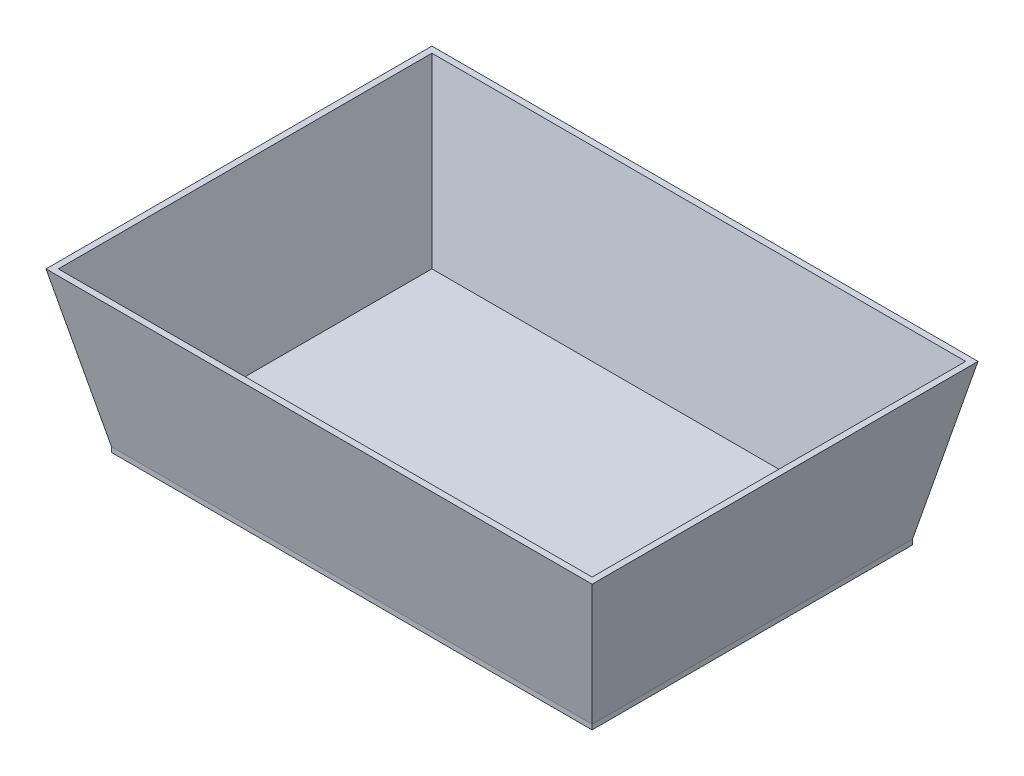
from build123d import *

# Parameters (mm, degrees)
SKETCH2_W           = 247.65
SKETCH2_H           = 165.1
BOSS_EXTRUDE2_DEPTH = 79.375
BOSS_EXTRUDE2_DRAFT = -12
SKETCH3_W           = 275.043354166
SKETCH3_H           = 192.493354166
CUT_EXTRUDE1_DEPTH  = 139.7
CUT_EXTRUDE1_DRAFT  = -12
SKETCH4_W           = 247.65
SKETCH4_H           = 165.1
BOSS_EXTRUDE3_DEPTH = 2.54


with BuildPart() as part:
    # Sketch2 → Boss-Extrude2 (with draft: the straight prism first)
    with BuildSketch(Plane(origin=(0, 0, 0), x_dir=(1, 0, 0), z_dir=(0, 1, 0))):
        Rectangle(SKETCH2_W, SKETCH2_H)
    extrude(amount=BOSS_EXTRUDE2_DEPTH)
    # Boss-Extrude2: the draft: its side faces are tilted about the plane it starts from
    boss_extrude2_sides = [part.faces().sort_by_distance(p)[0] for p in [
        (0, 39.6875, 82.55),
        (123.825, 39.6875, 0),
        (0, 39.6875, -82.55),
        (-123.825, 39.6875, 0),
    ]]
    draft(boss_extrude2_sides, Plane(origin=(0, 0, 0), x_dir=(1, 0, 0), z_dir=(0, 1, 0)), BOSS_EXTRUDE2_DRAFT)


with BuildPart() as cut_extrude1_tool:
    # Sketch3 → Cut-Extrude1 (with draft: the straight prism first)
    with BuildSketch(Plane(origin=(0, 79.375, 0), x_dir=(1, 0, 0), z_dir=(0, 1, 0))):
        Rectangle(SKETCH3_W, SKETCH3_H)
    extrude(amount=-CUT_EXTRUDE1_DEPTH)
    # Cut-Extrude1: the draft: its side faces are tilted about the plane it starts from
    cut_extrude1_sides = [cut_extrude1_tool.faces().sort_by_distance(p)[0] for p in [
        (0, 9.525, 96.246677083),
        (137.521677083, 9.525, 0),
        (0, 9.525, -96.246677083),
        (-137.521677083, 9.525, 0),
    ]]
    draft(cut_extrude1_sides, Plane(origin=(0, 79.375, 0), x_dir=(1, 0, 0), z_dir=(0, 1, 0)), CUT_EXTRUDE1_DRAFT)


with BuildPart() as part_1:
    add(part.part)

    # Cut-Extrude1: cut by cut_extrude1_tool
    add(cut_extrude1_tool.part, mode=Mode.SUBTRACT)

    # Sketch4 → Boss-Extrude3 (add)
    with BuildSketch(Plane.XZ):
        Rectangle(SKETCH4_W, SKETCH4_H)
    extrude(amount=BOSS_EXTRUDE3_DEPTH)


solid = part_1.part
